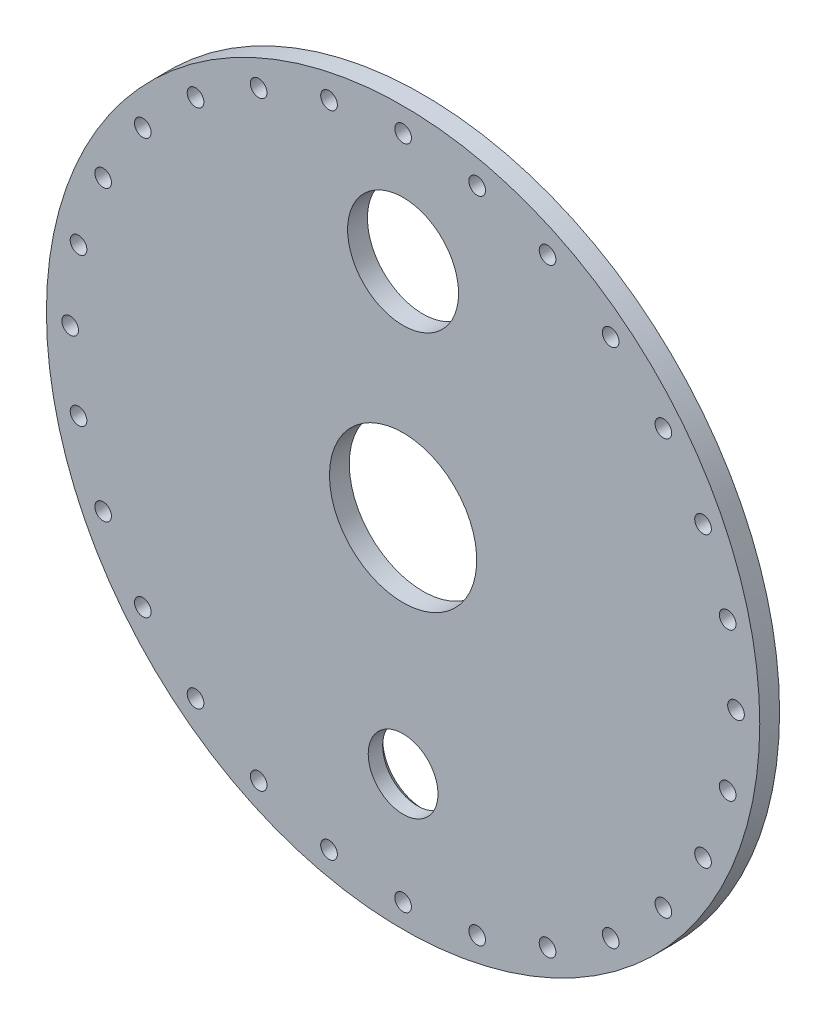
ISO-10303-21;
HEADER;
FILE_DESCRIPTION(('STEP AP214'),'2;1');
FILE_NAME('part.step','',(''),(''),'','','');
FILE_SCHEMA(('AUTOMOTIVE_DESIGN { 1 0 10303 214 1 1 1 1 }'));
ENDSEC;
DATA;
#1=APPLICATION_CONTEXT('core data for automotive mechanical design processes');
#2=APPLICATION_PROTOCOL_DEFINITION('international standard','automotive_design',2000,#1);
#3=PRODUCT_CONTEXT('',#1,'mechanical');
#4=PRODUCT('Part','Part','',(#3));
#5=PRODUCT_RELATED_PRODUCT_CATEGORY('part','',(#4));
#6=PRODUCT_DEFINITION_FORMATION('','',#4);
#7=PRODUCT_DEFINITION_CONTEXT('part definition',#1,'design');
#8=PRODUCT_DEFINITION('design','',#6,#7);
#9=PRODUCT_DEFINITION_SHAPE('','',#8);
#10=(LENGTH_UNIT() NAMED_UNIT(*) SI_UNIT(.MILLI.,.METRE.));
#11=(NAMED_UNIT(*) PLANE_ANGLE_UNIT() SI_UNIT($,.RADIAN.));
#12=(NAMED_UNIT(*) SI_UNIT($,.STERADIAN.) SOLID_ANGLE_UNIT());
#13=UNCERTAINTY_MEASURE_WITH_UNIT(LENGTH_MEASURE(1.E-05),#10,'distance_accuracy_value','');
#14=(GEOMETRIC_REPRESENTATION_CONTEXT(3) GLOBAL_UNCERTAINTY_ASSIGNED_CONTEXT((#13)) GLOBAL_UNIT_ASSIGNED_CONTEXT((#10,
#11,#12)) REPRESENTATION_CONTEXT('',''));
#15=CARTESIAN_POINT('',(0.,0.,0.));
#16=DIRECTION('',(0.,0.,1.));
#17=DIRECTION('',(1.,0.,0.));
#18=AXIS2_PLACEMENT_3D('',#15,#16,#17);
#19=CARTESIAN_POINT('',(0.,0.,0.));
#20=DIRECTION('',(0.,0.,1.));
#21=DIRECTION('',(1.,0.,0.));
#22=AXIS2_PLACEMENT_3D('',#19,#20,#21);
#23=PLANE('',#22);
#24=CARTESIAN_POINT('',(0.,0.,0.));
#25=DIRECTION('',(0.,0.,-1.));
#26=DIRECTION('',(-1.,0.,0.));
#27=AXIS2_PLACEMENT_3D('',#24,#25,#26);
#28=CIRCLE('',#27,46.45);
#29=CARTESIAN_POINT('',(-46.45,0.,0.));
#30=VERTEX_POINT('',#29);
#31=EDGE_CURVE('E224',#30,#30,#28,.T.);
#32=ORIENTED_EDGE('',*,*,#31,.F.);
#33=EDGE_LOOP('',(#32));
#34=FACE_BOUND('',#33,.T.);
#35=CARTESIAN_POINT('',(0.,0.,0.));
#36=DIRECTION('',(0.,0.,1.));
#37=DIRECTION('',(1.,0.,0.));
#38=AXIS2_PLACEMENT_3D('',#35,#36,#37);
#39=CIRCLE('',#38,225.);
#40=CARTESIAN_POINT('',(225.,0.,0.));
#41=VERTEX_POINT('',#40);
#42=EDGE_CURVE('E32',#41,#41,#39,.T.);
#43=ORIENTED_EDGE('',*,*,#42,.F.);
#44=EDGE_LOOP('',(#43));
#45=FACE_BOUND('',#44,.T.);
#46=CARTESIAN_POINT('',(0.,210.,0.));
#47=DIRECTION('',(0.,0.,1.));
#48=DIRECTION('',(1.,0.,0.));
#49=AXIS2_PLACEMENT_3D('',#46,#47,#48);
#50=CIRCLE('',#49,5.25);
#51=CARTESIAN_POINT('',(5.25,210.,0.));
#52=VERTEX_POINT('',#51);
#53=EDGE_CURVE('E39',#52,#52,#50,.T.);
#54=ORIENTED_EDGE('',*,*,#53,.T.);
#55=EDGE_LOOP('',(#54));
#56=FACE_BOUND('',#55,.T.);
#57=CARTESIAN_POINT('',(-46.7293961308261,204.734861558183,0.));
#58=DIRECTION('',(0.,0.,1.));
#59=DIRECTION('',(0.974927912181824,0.222520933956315,0.));
#60=AXIS2_PLACEMENT_3D('',#57,#58,#59);
#61=CIRCLE('',#60,5.25);
#62=CARTESIAN_POINT('',(-41.6110245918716,205.903096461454,0.));
#63=VERTEX_POINT('',#62);
#64=EDGE_CURVE('E44',#63,#63,#61,.T.);
#65=ORIENTED_EDGE('',*,*,#64,.T.);
#66=EDGE_LOOP('',(#65));
#67=FACE_BOUND('',#66,.T.);
#68=CARTESIAN_POINT('',(-91.1155852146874,189.203462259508,0.));
#69=DIRECTION('',(0.,0.,1.));
#70=DIRECTION('',(0.900968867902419,0.433883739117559,0.));
#71=AXIS2_PLACEMENT_3D('',#68,#69,#70);
#72=CIRCLE('',#71,5.25);
#73=CARTESIAN_POINT('',(-86.3854986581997,191.481351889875,0.));
#74=VERTEX_POINT('',#73);
#75=EDGE_CURVE('E50',#74,#74,#72,.T.);
#76=ORIENTED_EDGE('',*,*,#75,.T.);
#77=EDGE_LOOP('',(#76));
#78=FACE_BOUND('',#77,.T.);
#79=CARTESIAN_POINT('',(-130.932858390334,164.184611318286,0.));
#80=DIRECTION('',(0.,0.,1.));
#81=DIRECTION('',(0.781831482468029,0.623489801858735,0.));
#82=AXIS2_PLACEMENT_3D('',#79,#80,#81);
#83=CIRCLE('',#82,5.25);
#84=CARTESIAN_POINT('',(-126.828243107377,167.457932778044,0.));
#85=VERTEX_POINT('',#84);
#86=EDGE_CURVE('E56',#85,#85,#83,.T.);
#87=ORIENTED_EDGE('',*,*,#86,.T.);
#88=EDGE_LOOP('',(#87));
#89=FACE_BOUND('',#88,.T.);
#90=CARTESIAN_POINT('',(-164.184611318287,130.932858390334,0.));
#91=DIRECTION('',(0.,0.,1.));
#92=DIRECTION('',(0.623489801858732,0.781831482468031,0.));
#93=AXIS2_PLACEMENT_3D('',#90,#91,#92);
#94=CIRCLE('',#93,5.25);
#95=CARTESIAN_POINT('',(-160.911289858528,135.037473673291,0.));
#96=VERTEX_POINT('',#95);
#97=EDGE_CURVE('E62',#96,#96,#94,.T.);
#98=ORIENTED_EDGE('',*,*,#97,.T.);
#99=EDGE_LOOP('',(#98));
#100=FACE_BOUND('',#99,.T.);
#101=CARTESIAN_POINT('',(-189.203462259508,91.1155852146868,0.));
#102=DIRECTION('',(0.,0.,1.));
#103=DIRECTION('',(0.433883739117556,0.90096886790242,0.));
#104=AXIS2_PLACEMENT_3D('',#101,#102,#103);
#105=CIRCLE('',#104,5.25);
#106=CARTESIAN_POINT('',(-186.925572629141,95.8456717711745,0.));
#107=VERTEX_POINT('',#106);
#108=EDGE_CURVE('E68',#107,#107,#105,.T.);
#109=ORIENTED_EDGE('',*,*,#108,.T.);
#110=EDGE_LOOP('',(#109));
#111=FACE_BOUND('',#110,.T.);
#112=CARTESIAN_POINT('',(-204.734861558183,46.7293961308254,0.));
#113=DIRECTION('',(0.,0.,1.));
#114=DIRECTION('',(0.222520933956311,0.974927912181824,0.));
#115=AXIS2_PLACEMENT_3D('',#112,#113,#114);
#116=CIRCLE('',#115,5.25);
#117=CARTESIAN_POINT('',(-203.566626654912,51.84776766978,0.));
#118=VERTEX_POINT('',#117);
#119=EDGE_CURVE('E74',#118,#118,#116,.T.);
#120=ORIENTED_EDGE('',*,*,#119,.T.);
#121=EDGE_LOOP('',(#120));
#122=FACE_BOUND('',#121,.T.);
#123=CARTESIAN_POINT('',(-210.,-7.33211081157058E-13,0.));
#124=DIRECTION('',(0.,0.,1.));
#125=DIRECTION('',(0.,1.,0.));
#126=AXIS2_PLACEMENT_3D('',#123,#124,#125);
#127=CIRCLE('',#126,5.25);
#128=CARTESIAN_POINT('',(-210.,5.24999999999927,0.));
#129=VERTEX_POINT('',#128);
#130=EDGE_CURVE('E80',#129,#129,#127,.T.);
#131=ORIENTED_EDGE('',*,*,#130,.T.);
#132=EDGE_LOOP('',(#131));
#133=FACE_BOUND('',#132,.T.);
#134=CARTESIAN_POINT('',(-204.734861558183,-46.7293961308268,0.));
#135=DIRECTION('',(0.,0.,1.));
#136=DIRECTION('',(-0.222520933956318,0.974927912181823,0.));
#137=AXIS2_PLACEMENT_3D('',#134,#135,#136);
#138=CIRCLE('',#137,5.25);
#139=CARTESIAN_POINT('',(-205.903096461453,-41.6110245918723,0.));
#140=VERTEX_POINT('',#139);
#141=EDGE_CURVE('E86',#140,#140,#138,.T.);
#142=ORIENTED_EDGE('',*,*,#141,.T.);
#143=EDGE_LOOP('',(#142));
#144=FACE_BOUND('',#143,.T.);
#145=CARTESIAN_POINT('',(-189.203462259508,-91.115585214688,0.));
#146=DIRECTION('',(0.,0.,1.));
#147=DIRECTION('',(-0.433883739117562,0.900968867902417,0.));
#148=AXIS2_PLACEMENT_3D('',#145,#146,#147);
#149=CIRCLE('',#148,5.25);
#150=CARTESIAN_POINT('',(-191.481351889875,-86.3854986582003,0.));
#151=VERTEX_POINT('',#150);
#152=EDGE_CURVE('E92',#151,#151,#149,.T.);
#153=ORIENTED_EDGE('',*,*,#152,.T.);
#154=EDGE_LOOP('',(#153));
#155=FACE_BOUND('',#154,.T.);
#156=CARTESIAN_POINT('',(-164.184611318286,-130.932858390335,0.));
#157=DIRECTION('',(0.,0.,1.));
#158=DIRECTION('',(-0.623489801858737,0.781831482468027,0.));
#159=AXIS2_PLACEMENT_3D('',#156,#157,#158);
#160=CIRCLE('',#159,5.25);
#161=CARTESIAN_POINT('',(-167.457932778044,-126.828243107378,0.));
#162=VERTEX_POINT('',#161);
#163=EDGE_CURVE('E98',#162,#162,#160,.T.);
#164=ORIENTED_EDGE('',*,*,#163,.T.);
#165=EDGE_LOOP('',(#164));
#166=FACE_BOUND('',#165,.T.);
#167=CARTESIAN_POINT('',(-130.932858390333,-164.184611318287,0.));
#168=DIRECTION('',(0.,0.,1.));
#169=DIRECTION('',(-0.781831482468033,0.623489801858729,0.));
#170=AXIS2_PLACEMENT_3D('',#167,#168,#169);
#171=CIRCLE('',#170,5.25);
#172=CARTESIAN_POINT('',(-135.03747367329,-160.911289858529,0.));
#173=VERTEX_POINT('',#172);
#174=EDGE_CURVE('E104',#173,#173,#171,.T.);
#175=ORIENTED_EDGE('',*,*,#174,.T.);
#176=EDGE_LOOP('',(#175));
#177=FACE_BOUND('',#176,.T.);
#178=CARTESIAN_POINT('',(-91.115585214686,-189.203462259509,0.));
#179=DIRECTION('',(0.,0.,1.));
#180=DIRECTION('',(-0.900968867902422,0.433883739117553,0.));
#181=AXIS2_PLACEMENT_3D('',#178,#179,#180);
#182=CIRCLE('',#181,5.25);
#183=CARTESIAN_POINT('',(-95.8456717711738,-186.925572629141,0.));
#184=VERTEX_POINT('',#183);
#185=EDGE_CURVE('E110',#184,#184,#182,.T.);
#186=ORIENTED_EDGE('',*,*,#185,.T.);
#187=EDGE_LOOP('',(#186));
#188=FACE_BOUND('',#187,.T.);
#189=CARTESIAN_POINT('',(-46.7293961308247,-204.734861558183,0.));
#190=DIRECTION('',(0.,0.,1.));
#191=DIRECTION('',(-0.974927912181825,0.222520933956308,0.));
#192=AXIS2_PLACEMENT_3D('',#189,#190,#191);
#193=CIRCLE('',#192,5.25);
#194=CARTESIAN_POINT('',(-51.8477676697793,-203.566626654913,0.));
#195=VERTEX_POINT('',#194);
#196=EDGE_CURVE('E116',#195,#195,#193,.T.);
#197=ORIENTED_EDGE('',*,*,#196,.T.);
#198=EDGE_LOOP('',(#197));
#199=FACE_BOUND('',#198,.T.);
#200=CARTESIAN_POINT('',(0.,-210.,0.));
#201=DIRECTION('',(0.,0.,1.));
#202=DIRECTION('',(-1.,0.,0.));
#203=AXIS2_PLACEMENT_3D('',#200,#201,#202);
#204=CIRCLE('',#203,5.25);
#205=CARTESIAN_POINT('',(-5.25,-210.,0.));
#206=VERTEX_POINT('',#205);
#207=EDGE_CURVE('E122',#206,#206,#204,.T.);
#208=ORIENTED_EDGE('',*,*,#207,.T.);
#209=EDGE_LOOP('',(#208));
#210=FACE_BOUND('',#209,.T.);
#211=CARTESIAN_POINT('',(46.7293961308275,-204.734861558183,0.));
#212=DIRECTION('',(0.,0.,1.));
#213=DIRECTION('',(-0.974927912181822,-0.222520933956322,0.));
#214=AXIS2_PLACEMENT_3D('',#211,#212,#213);
#215=CIRCLE('',#214,5.25);
#216=CARTESIAN_POINT('',(41.611024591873,-205.903096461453,0.));
#217=VERTEX_POINT('',#216);
#218=EDGE_CURVE('E128',#217,#217,#215,.T.);
#219=ORIENTED_EDGE('',*,*,#218,.T.);
#220=EDGE_LOOP('',(#219));
#221=FACE_BOUND('',#220,.T.);
#222=CARTESIAN_POINT('',(91.1155852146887,-189.203462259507,0.));
#223=DIRECTION('',(0.,0.,1.));
#224=DIRECTION('',(-0.900968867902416,-0.433883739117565,0.));
#225=AXIS2_PLACEMENT_3D('',#222,#223,#224);
#226=CIRCLE('',#225,5.25);
#227=CARTESIAN_POINT('',(86.385498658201,-191.481351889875,0.));
#228=VERTEX_POINT('',#227);
#229=EDGE_CURVE('E134',#228,#228,#226,.T.);
#230=ORIENTED_EDGE('',*,*,#229,.T.);
#231=EDGE_LOOP('',(#230));
#232=FACE_BOUND('',#231,.T.);
#233=CARTESIAN_POINT('',(130.932858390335,-164.184611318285,0.));
#234=DIRECTION('',(0.,0.,1.));
#235=DIRECTION('',(-0.781831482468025,-0.62348980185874,0.));
#236=AXIS2_PLACEMENT_3D('',#233,#234,#235);
#237=CIRCLE('',#236,5.25);
#238=CARTESIAN_POINT('',(126.828243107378,-167.457932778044,0.));
#239=VERTEX_POINT('',#238);
#240=EDGE_CURVE('E140',#239,#239,#237,.T.);
#241=ORIENTED_EDGE('',*,*,#240,.T.);
#242=EDGE_LOOP('',(#241));
#243=FACE_BOUND('',#242,.T.);
#244=CARTESIAN_POINT('',(164.184611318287,-130.932858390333,0.));
#245=DIRECTION('',(0.,0.,1.));
#246=DIRECTION('',(-0.623489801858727,-0.781831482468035,0.));
#247=AXIS2_PLACEMENT_3D('',#244,#245,#246);
#248=CIRCLE('',#247,5.25);
#249=CARTESIAN_POINT('',(160.911289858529,-135.03747367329,0.));
#250=VERTEX_POINT('',#249);
#251=EDGE_CURVE('E146',#250,#250,#248,.T.);
#252=ORIENTED_EDGE('',*,*,#251,.T.);
#253=EDGE_LOOP('',(#252));
#254=FACE_BOUND('',#253,.T.);
#255=CARTESIAN_POINT('',(189.203462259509,-91.1155852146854,0.));
#256=DIRECTION('',(0.,0.,1.));
#257=DIRECTION('',(-0.433883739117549,-0.900968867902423,0.));
#258=AXIS2_PLACEMENT_3D('',#255,#256,#257);
#259=CIRCLE('',#258,5.25);
#260=CARTESIAN_POINT('',(186.925572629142,-95.8456717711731,0.));
#261=VERTEX_POINT('',#260);
#262=EDGE_CURVE('E152',#261,#261,#259,.T.);
#263=ORIENTED_EDGE('',*,*,#262,.T.);
#264=EDGE_LOOP('',(#263));
#265=FACE_BOUND('',#264,.T.);
#266=CARTESIAN_POINT('',(204.734861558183,-46.7293961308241,0.));
#267=DIRECTION('',(0.,0.,1.));
#268=DIRECTION('',(-0.222520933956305,-0.974927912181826,0.));
#269=AXIS2_PLACEMENT_3D('',#266,#267,#268);
#270=CIRCLE('',#269,5.25);
#271=CARTESIAN_POINT('',(203.566626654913,-51.8477676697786,0.));
#272=VERTEX_POINT('',#271);
#273=EDGE_CURVE('E158',#272,#272,#270,.T.);
#274=ORIENTED_EDGE('',*,*,#273,.T.);
#275=EDGE_LOOP('',(#274));
#276=FACE_BOUND('',#275,.T.);
#277=CARTESIAN_POINT('',(210.,2.19963324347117E-12,0.));
#278=DIRECTION('',(0.,0.,1.));
#279=DIRECTION('',(0.,-1.,0.));
#280=AXIS2_PLACEMENT_3D('',#277,#278,#279);
#281=CIRCLE('',#280,5.25);
#282=CARTESIAN_POINT('',(210.,-5.2499999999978,0.));
#283=VERTEX_POINT('',#282);
#284=EDGE_CURVE('E164',#283,#283,#281,.T.);
#285=ORIENTED_EDGE('',*,*,#284,.T.);
#286=EDGE_LOOP('',(#285));
#287=FACE_BOUND('',#286,.T.);
#288=CARTESIAN_POINT('',(204.734861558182,46.7293961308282,0.));
#289=DIRECTION('',(0.,0.,1.));
#290=DIRECTION('',(0.222520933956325,-0.974927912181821,0.));
#291=AXIS2_PLACEMENT_3D('',#288,#289,#290);
#292=CIRCLE('',#291,5.25);
#293=CARTESIAN_POINT('',(205.903096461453,41.6110245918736,0.));
#294=VERTEX_POINT('',#293);
#295=EDGE_CURVE('E170',#294,#294,#292,.T.);
#296=ORIENTED_EDGE('',*,*,#295,.T.);
#297=EDGE_LOOP('',(#296));
#298=FACE_BOUND('',#297,.T.);
#299=CARTESIAN_POINT('',(189.203462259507,91.1155852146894,0.));
#300=DIRECTION('',(0.,0.,1.));
#301=DIRECTION('',(0.433883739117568,-0.900968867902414,0.));
#302=AXIS2_PLACEMENT_3D('',#299,#300,#301);
#303=CIRCLE('',#302,5.25);
#304=CARTESIAN_POINT('',(191.481351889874,86.3854986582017,0.));
#305=VERTEX_POINT('',#304);
#306=EDGE_CURVE('E176',#305,#305,#303,.T.);
#307=ORIENTED_EDGE('',*,*,#306,.T.);
#308=EDGE_LOOP('',(#307));
#309=FACE_BOUND('',#308,.T.);
#310=CARTESIAN_POINT('',(164.184611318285,130.932858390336,0.));
#311=DIRECTION('',(0.,0.,1.));
#312=DIRECTION('',(0.623489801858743,-0.781831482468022,0.));
#313=AXIS2_PLACEMENT_3D('',#310,#311,#312);
#314=CIRCLE('',#313,5.25);
#315=CARTESIAN_POINT('',(167.457932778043,126.828243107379,0.));
#316=VERTEX_POINT('',#315);
#317=EDGE_CURVE('E182',#316,#316,#314,.T.);
#318=ORIENTED_EDGE('',*,*,#317,.T.);
#319=EDGE_LOOP('',(#318));
#320=FACE_BOUND('',#319,.T.);
#321=CARTESIAN_POINT('',(130.932858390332,164.184611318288,0.));
#322=DIRECTION('',(0.,0.,1.));
#323=DIRECTION('',(0.781831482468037,-0.623489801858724,0.));
#324=AXIS2_PLACEMENT_3D('',#321,#322,#323);
#325=CIRCLE('',#324,5.25);
#326=CARTESIAN_POINT('',(135.037473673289,160.91128985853,0.));
#327=VERTEX_POINT('',#326);
#328=EDGE_CURVE('E188',#327,#327,#325,.T.);
#329=ORIENTED_EDGE('',*,*,#328,.T.);
#330=EDGE_LOOP('',(#329));
#331=FACE_BOUND('',#330,.T.);
#332=CARTESIAN_POINT('',(91.1155852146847,189.203462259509,0.));
#333=DIRECTION('',(0.,0.,1.));
#334=DIRECTION('',(0.900968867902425,-0.433883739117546,0.));
#335=AXIS2_PLACEMENT_3D('',#332,#333,#334);
#336=CIRCLE('',#335,5.25);
#337=CARTESIAN_POINT('',(95.8456717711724,186.925572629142,0.));
#338=VERTEX_POINT('',#337);
#339=EDGE_CURVE('E194',#338,#338,#336,.T.);
#340=ORIENTED_EDGE('',*,*,#339,.T.);
#341=EDGE_LOOP('',(#340));
#342=FACE_BOUND('',#341,.T.);
#343=CARTESIAN_POINT('',(46.7293961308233,204.734861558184,0.));
#344=DIRECTION('',(0.,0.,1.));
#345=DIRECTION('',(0.974927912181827,-0.222520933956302,0.));
#346=AXIS2_PLACEMENT_3D('',#343,#344,#345);
#347=CIRCLE('',#346,5.25);
#348=CARTESIAN_POINT('',(51.8477676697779,203.566626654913,0.));
#349=VERTEX_POINT('',#348);
#350=EDGE_CURVE('E200',#349,#349,#347,.T.);
#351=ORIENTED_EDGE('',*,*,#350,.T.);
#352=EDGE_LOOP('',(#351));
#353=FACE_BOUND('',#352,.T.);
#354=CARTESIAN_POINT('',(0.,140.,0.));
#355=DIRECTION('',(0.,0.,1.));
#356=DIRECTION('',(1.,0.,0.));
#357=AXIS2_PLACEMENT_3D('',#354,#355,#356);
#358=CIRCLE('',#357,35.);
#359=CARTESIAN_POINT('',(35.,140.,0.));
#360=VERTEX_POINT('',#359);
#361=EDGE_CURVE('E206',#360,#360,#358,.T.);
#362=ORIENTED_EDGE('',*,*,#361,.T.);
#363=EDGE_LOOP('',(#362));
#364=FACE_BOUND('',#363,.T.);
#365=CARTESIAN_POINT('',(0.,-140.,0.));
#366=DIRECTION('',(0.,0.,-1.));
#367=DIRECTION('',(-1.,0.,0.));
#368=AXIS2_PLACEMENT_3D('',#365,#366,#367);
#369=CIRCLE('',#368,25.4);
#370=CARTESIAN_POINT('',(-25.4,-140.,0.));
#371=VERTEX_POINT('',#370);
#372=EDGE_CURVE('E220',#371,#371,#369,.T.);
#373=ORIENTED_EDGE('',*,*,#372,.F.);
#374=EDGE_LOOP('',(#373));
#375=FACE_BOUND('',#374,.T.);
#376=ADVANCED_FACE('F28',(#34,#45,#56,#67,#78,#89,#100,#111,#122,#133,#144,#155,#166,#177,#188,
#199,#210,#221,#232,#243,#254,#265,#276,#287,#298,#309,#320,#331,#342,#353,#364,#375),#23,.F.);
#377=CARTESIAN_POINT('',(0.,0.,12.5));
#378=DIRECTION('',(0.,0.,1.));
#379=DIRECTION('',(1.,0.,0.));
#380=AXIS2_PLACEMENT_3D('',#377,#378,#379);
#381=PLANE('',#380);
#382=CARTESIAN_POINT('',(0.,0.,12.5));
#383=DIRECTION('',(0.,0.,-1.));
#384=DIRECTION('',(-1.,0.,0.));
#385=AXIS2_PLACEMENT_3D('',#382,#383,#384);
#386=CIRCLE('',#385,46.45);
#387=CARTESIAN_POINT('',(-46.45,0.,12.5));
#388=VERTEX_POINT('',#387);
#389=EDGE_CURVE('E223',#388,#388,#386,.T.);
#390=ORIENTED_EDGE('',*,*,#389,.T.);
#391=EDGE_LOOP('',(#390));
#392=FACE_BOUND('',#391,.T.);
#393=CARTESIAN_POINT('',(0.,0.,12.5));
#394=DIRECTION('',(0.,0.,1.));
#395=DIRECTION('',(1.,0.,0.));
#396=AXIS2_PLACEMENT_3D('',#393,#394,#395);
#397=CIRCLE('',#396,225.);
#398=CARTESIAN_POINT('',(225.,0.,12.5));
#399=VERTEX_POINT('',#398);
#400=EDGE_CURVE('E10',#399,#399,#397,.T.);
#401=ORIENTED_EDGE('',*,*,#400,.T.);
#402=EDGE_LOOP('',(#401));
#403=FACE_BOUND('',#402,.T.);
#404=CARTESIAN_POINT('',(0.,210.,12.5));
#405=DIRECTION('',(0.,0.,1.));
#406=DIRECTION('',(1.,0.,0.));
#407=AXIS2_PLACEMENT_3D('',#404,#405,#406);
#408=CIRCLE('',#407,5.25);
#409=CARTESIAN_POINT('',(5.25,210.,12.5));
#410=VERTEX_POINT('',#409);
#411=EDGE_CURVE('E41',#410,#410,#408,.T.);
#412=ORIENTED_EDGE('',*,*,#411,.F.);
#413=EDGE_LOOP('',(#412));
#414=FACE_BOUND('',#413,.T.);
#415=CARTESIAN_POINT('',(-46.7293961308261,204.734861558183,12.5));
#416=DIRECTION('',(0.,0.,1.));
#417=DIRECTION('',(0.974927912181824,0.222520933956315,0.));
#418=AXIS2_PLACEMENT_3D('',#415,#416,#417);
#419=CIRCLE('',#418,5.25);
#420=CARTESIAN_POINT('',(-41.6110245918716,205.903096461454,12.5));
#421=VERTEX_POINT('',#420);
#422=EDGE_CURVE('E47',#421,#421,#419,.T.);
#423=ORIENTED_EDGE('',*,*,#422,.F.);
#424=EDGE_LOOP('',(#423));
#425=FACE_BOUND('',#424,.T.);
#426=CARTESIAN_POINT('',(-91.1155852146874,189.203462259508,12.5));
#427=DIRECTION('',(0.,0.,1.));
#428=DIRECTION('',(0.900968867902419,0.433883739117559,0.));
#429=AXIS2_PLACEMENT_3D('',#426,#427,#428);
#430=CIRCLE('',#429,5.25);
#431=CARTESIAN_POINT('',(-86.3854986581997,191.481351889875,12.5));
#432=VERTEX_POINT('',#431);
#433=EDGE_CURVE('E53',#432,#432,#430,.T.);
#434=ORIENTED_EDGE('',*,*,#433,.F.);
#435=EDGE_LOOP('',(#434));
#436=FACE_BOUND('',#435,.T.);
#437=CARTESIAN_POINT('',(-130.932858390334,164.184611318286,12.5));
#438=DIRECTION('',(0.,0.,1.));
#439=DIRECTION('',(0.781831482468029,0.623489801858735,0.));
#440=AXIS2_PLACEMENT_3D('',#437,#438,#439);
#441=CIRCLE('',#440,5.25);
#442=CARTESIAN_POINT('',(-126.828243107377,167.457932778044,12.5));
#443=VERTEX_POINT('',#442);
#444=EDGE_CURVE('E59',#443,#443,#441,.T.);
#445=ORIENTED_EDGE('',*,*,#444,.F.);
#446=EDGE_LOOP('',(#445));
#447=FACE_BOUND('',#446,.T.);
#448=CARTESIAN_POINT('',(-164.184611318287,130.932858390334,12.5));
#449=DIRECTION('',(0.,0.,1.));
#450=DIRECTION('',(0.623489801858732,0.781831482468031,0.));
#451=AXIS2_PLACEMENT_3D('',#448,#449,#450);
#452=CIRCLE('',#451,5.25);
#453=CARTESIAN_POINT('',(-160.911289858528,135.037473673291,12.5));
#454=VERTEX_POINT('',#453);
#455=EDGE_CURVE('E65',#454,#454,#452,.T.);
#456=ORIENTED_EDGE('',*,*,#455,.F.);
#457=EDGE_LOOP('',(#456));
#458=FACE_BOUND('',#457,.T.);
#459=CARTESIAN_POINT('',(-189.203462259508,91.1155852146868,12.5));
#460=DIRECTION('',(0.,0.,1.));
#461=DIRECTION('',(0.433883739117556,0.90096886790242,0.));
#462=AXIS2_PLACEMENT_3D('',#459,#460,#461);
#463=CIRCLE('',#462,5.25);
#464=CARTESIAN_POINT('',(-186.925572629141,95.8456717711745,12.5));
#465=VERTEX_POINT('',#464);
#466=EDGE_CURVE('E71',#465,#465,#463,.T.);
#467=ORIENTED_EDGE('',*,*,#466,.F.);
#468=EDGE_LOOP('',(#467));
#469=FACE_BOUND('',#468,.T.);
#470=CARTESIAN_POINT('',(-204.734861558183,46.7293961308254,12.5));
#471=DIRECTION('',(0.,0.,1.));
#472=DIRECTION('',(0.222520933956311,0.974927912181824,0.));
#473=AXIS2_PLACEMENT_3D('',#470,#471,#472);
#474=CIRCLE('',#473,5.25);
#475=CARTESIAN_POINT('',(-203.566626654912,51.84776766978,12.5));
#476=VERTEX_POINT('',#475);
#477=EDGE_CURVE('E77',#476,#476,#474,.T.);
#478=ORIENTED_EDGE('',*,*,#477,.F.);
#479=EDGE_LOOP('',(#478));
#480=FACE_BOUND('',#479,.T.);
#481=CARTESIAN_POINT('',(-210.,-7.33211081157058E-13,12.5));
#482=DIRECTION('',(0.,0.,1.));
#483=DIRECTION('',(0.,1.,0.));
#484=AXIS2_PLACEMENT_3D('',#481,#482,#483);
#485=CIRCLE('',#484,5.25);
#486=CARTESIAN_POINT('',(-210.,5.24999999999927,12.5));
#487=VERTEX_POINT('',#486);
#488=EDGE_CURVE('E83',#487,#487,#485,.T.);
#489=ORIENTED_EDGE('',*,*,#488,.F.);
#490=EDGE_LOOP('',(#489));
#491=FACE_BOUND('',#490,.T.);
#492=CARTESIAN_POINT('',(-204.734861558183,-46.7293961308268,12.5));
#493=DIRECTION('',(0.,0.,1.));
#494=DIRECTION('',(-0.222520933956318,0.974927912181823,0.));
#495=AXIS2_PLACEMENT_3D('',#492,#493,#494);
#496=CIRCLE('',#495,5.25);
#497=CARTESIAN_POINT('',(-205.903096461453,-41.6110245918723,12.5));
#498=VERTEX_POINT('',#497);
#499=EDGE_CURVE('E89',#498,#498,#496,.T.);
#500=ORIENTED_EDGE('',*,*,#499,.F.);
#501=EDGE_LOOP('',(#500));
#502=FACE_BOUND('',#501,.T.);
#503=CARTESIAN_POINT('',(-189.203462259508,-91.115585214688,12.5));
#504=DIRECTION('',(0.,0.,1.));
#505=DIRECTION('',(-0.433883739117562,0.900968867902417,0.));
#506=AXIS2_PLACEMENT_3D('',#503,#504,#505);
#507=CIRCLE('',#506,5.25);
#508=CARTESIAN_POINT('',(-191.481351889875,-86.3854986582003,12.5));
#509=VERTEX_POINT('',#508);
#510=EDGE_CURVE('E95',#509,#509,#507,.T.);
#511=ORIENTED_EDGE('',*,*,#510,.F.);
#512=EDGE_LOOP('',(#511));
#513=FACE_BOUND('',#512,.T.);
#514=CARTESIAN_POINT('',(-164.184611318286,-130.932858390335,12.5));
#515=DIRECTION('',(0.,0.,1.));
#516=DIRECTION('',(-0.623489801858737,0.781831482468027,0.));
#517=AXIS2_PLACEMENT_3D('',#514,#515,#516);
#518=CIRCLE('',#517,5.25);
#519=CARTESIAN_POINT('',(-167.457932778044,-126.828243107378,12.5));
#520=VERTEX_POINT('',#519);
#521=EDGE_CURVE('E101',#520,#520,#518,.T.);
#522=ORIENTED_EDGE('',*,*,#521,.F.);
#523=EDGE_LOOP('',(#522));
#524=FACE_BOUND('',#523,.T.);
#525=CARTESIAN_POINT('',(-130.932858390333,-164.184611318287,12.5));
#526=DIRECTION('',(0.,0.,1.));
#527=DIRECTION('',(-0.781831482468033,0.623489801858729,0.));
#528=AXIS2_PLACEMENT_3D('',#525,#526,#527);
#529=CIRCLE('',#528,5.25);
#530=CARTESIAN_POINT('',(-135.03747367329,-160.911289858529,12.5));
#531=VERTEX_POINT('',#530);
#532=EDGE_CURVE('E107',#531,#531,#529,.T.);
#533=ORIENTED_EDGE('',*,*,#532,.F.);
#534=EDGE_LOOP('',(#533));
#535=FACE_BOUND('',#534,.T.);
#536=CARTESIAN_POINT('',(-91.115585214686,-189.203462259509,12.5));
#537=DIRECTION('',(0.,0.,1.));
#538=DIRECTION('',(-0.900968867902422,0.433883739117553,0.));
#539=AXIS2_PLACEMENT_3D('',#536,#537,#538);
#540=CIRCLE('',#539,5.25);
#541=CARTESIAN_POINT('',(-95.8456717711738,-186.925572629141,12.5));
#542=VERTEX_POINT('',#541);
#543=EDGE_CURVE('E113',#542,#542,#540,.T.);
#544=ORIENTED_EDGE('',*,*,#543,.F.);
#545=EDGE_LOOP('',(#544));
#546=FACE_BOUND('',#545,.T.);
#547=CARTESIAN_POINT('',(-46.7293961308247,-204.734861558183,12.5));
#548=DIRECTION('',(0.,0.,1.));
#549=DIRECTION('',(-0.974927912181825,0.222520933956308,0.));
#550=AXIS2_PLACEMENT_3D('',#547,#548,#549);
#551=CIRCLE('',#550,5.25);
#552=CARTESIAN_POINT('',(-51.8477676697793,-203.566626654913,12.5));
#553=VERTEX_POINT('',#552);
#554=EDGE_CURVE('E119',#553,#553,#551,.T.);
#555=ORIENTED_EDGE('',*,*,#554,.F.);
#556=EDGE_LOOP('',(#555));
#557=FACE_BOUND('',#556,.T.);
#558=CARTESIAN_POINT('',(0.,-210.,12.5));
#559=DIRECTION('',(0.,0.,1.));
#560=DIRECTION('',(-1.,0.,0.));
#561=AXIS2_PLACEMENT_3D('',#558,#559,#560);
#562=CIRCLE('',#561,5.25);
#563=CARTESIAN_POINT('',(-5.25,-210.,12.5));
#564=VERTEX_POINT('',#563);
#565=EDGE_CURVE('E125',#564,#564,#562,.T.);
#566=ORIENTED_EDGE('',*,*,#565,.F.);
#567=EDGE_LOOP('',(#566));
#568=FACE_BOUND('',#567,.T.);
#569=CARTESIAN_POINT('',(46.7293961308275,-204.734861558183,12.5));
#570=DIRECTION('',(0.,0.,1.));
#571=DIRECTION('',(-0.974927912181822,-0.222520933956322,0.));
#572=AXIS2_PLACEMENT_3D('',#569,#570,#571);
#573=CIRCLE('',#572,5.25);
#574=CARTESIAN_POINT('',(41.611024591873,-205.903096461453,12.5));
#575=VERTEX_POINT('',#574);
#576=EDGE_CURVE('E131',#575,#575,#573,.T.);
#577=ORIENTED_EDGE('',*,*,#576,.F.);
#578=EDGE_LOOP('',(#577));
#579=FACE_BOUND('',#578,.T.);
#580=CARTESIAN_POINT('',(91.1155852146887,-189.203462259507,12.5));
#581=DIRECTION('',(0.,0.,1.));
#582=DIRECTION('',(-0.900968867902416,-0.433883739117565,0.));
#583=AXIS2_PLACEMENT_3D('',#580,#581,#582);
#584=CIRCLE('',#583,5.25);
#585=CARTESIAN_POINT('',(86.385498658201,-191.481351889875,12.5));
#586=VERTEX_POINT('',#585);
#587=EDGE_CURVE('E137',#586,#586,#584,.T.);
#588=ORIENTED_EDGE('',*,*,#587,.F.);
#589=EDGE_LOOP('',(#588));
#590=FACE_BOUND('',#589,.T.);
#591=CARTESIAN_POINT('',(130.932858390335,-164.184611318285,12.5));
#592=DIRECTION('',(0.,0.,1.));
#593=DIRECTION('',(-0.781831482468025,-0.62348980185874,0.));
#594=AXIS2_PLACEMENT_3D('',#591,#592,#593);
#595=CIRCLE('',#594,5.25);
#596=CARTESIAN_POINT('',(126.828243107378,-167.457932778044,12.5));
#597=VERTEX_POINT('',#596);
#598=EDGE_CURVE('E143',#597,#597,#595,.T.);
#599=ORIENTED_EDGE('',*,*,#598,.F.);
#600=EDGE_LOOP('',(#599));
#601=FACE_BOUND('',#600,.T.);
#602=CARTESIAN_POINT('',(164.184611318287,-130.932858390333,12.5));
#603=DIRECTION('',(0.,0.,1.));
#604=DIRECTION('',(-0.623489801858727,-0.781831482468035,0.));
#605=AXIS2_PLACEMENT_3D('',#602,#603,#604);
#606=CIRCLE('',#605,5.25);
#607=CARTESIAN_POINT('',(160.911289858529,-135.03747367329,12.5));
#608=VERTEX_POINT('',#607);
#609=EDGE_CURVE('E149',#608,#608,#606,.T.);
#610=ORIENTED_EDGE('',*,*,#609,.F.);
#611=EDGE_LOOP('',(#610));
#612=FACE_BOUND('',#611,.T.);
#613=CARTESIAN_POINT('',(189.203462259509,-91.1155852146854,12.5));
#614=DIRECTION('',(0.,0.,1.));
#615=DIRECTION('',(-0.433883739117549,-0.900968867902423,0.));
#616=AXIS2_PLACEMENT_3D('',#613,#614,#615);
#617=CIRCLE('',#616,5.25);
#618=CARTESIAN_POINT('',(186.925572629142,-95.8456717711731,12.5));
#619=VERTEX_POINT('',#618);
#620=EDGE_CURVE('E155',#619,#619,#617,.T.);
#621=ORIENTED_EDGE('',*,*,#620,.F.);
#622=EDGE_LOOP('',(#621));
#623=FACE_BOUND('',#622,.T.);
#624=CARTESIAN_POINT('',(204.734861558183,-46.7293961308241,12.5));
#625=DIRECTION('',(0.,0.,1.));
#626=DIRECTION('',(-0.222520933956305,-0.974927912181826,0.));
#627=AXIS2_PLACEMENT_3D('',#624,#625,#626);
#628=CIRCLE('',#627,5.25);
#629=CARTESIAN_POINT('',(203.566626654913,-51.8477676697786,12.5));
#630=VERTEX_POINT('',#629);
#631=EDGE_CURVE('E161',#630,#630,#628,.T.);
#632=ORIENTED_EDGE('',*,*,#631,.F.);
#633=EDGE_LOOP('',(#632));
#634=FACE_BOUND('',#633,.T.);
#635=CARTESIAN_POINT('',(210.,2.19963324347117E-12,12.5));
#636=DIRECTION('',(0.,0.,1.));
#637=DIRECTION('',(0.,-1.,0.));
#638=AXIS2_PLACEMENT_3D('',#635,#636,#637);
#639=CIRCLE('',#638,5.25);
#640=CARTESIAN_POINT('',(210.,-5.2499999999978,12.5));
#641=VERTEX_POINT('',#640);
#642=EDGE_CURVE('E167',#641,#641,#639,.T.);
#643=ORIENTED_EDGE('',*,*,#642,.F.);
#644=EDGE_LOOP('',(#643));
#645=FACE_BOUND('',#644,.T.);
#646=CARTESIAN_POINT('',(204.734861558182,46.7293961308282,12.5));
#647=DIRECTION('',(0.,0.,1.));
#648=DIRECTION('',(0.222520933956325,-0.974927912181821,0.));
#649=AXIS2_PLACEMENT_3D('',#646,#647,#648);
#650=CIRCLE('',#649,5.25);
#651=CARTESIAN_POINT('',(205.903096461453,41.6110245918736,12.5));
#652=VERTEX_POINT('',#651);
#653=EDGE_CURVE('E173',#652,#652,#650,.T.);
#654=ORIENTED_EDGE('',*,*,#653,.F.);
#655=EDGE_LOOP('',(#654));
#656=FACE_BOUND('',#655,.T.);
#657=CARTESIAN_POINT('',(189.203462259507,91.1155852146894,12.5));
#658=DIRECTION('',(0.,0.,1.));
#659=DIRECTION('',(0.433883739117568,-0.900968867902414,0.));
#660=AXIS2_PLACEMENT_3D('',#657,#658,#659);
#661=CIRCLE('',#660,5.25);
#662=CARTESIAN_POINT('',(191.481351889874,86.3854986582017,12.5));
#663=VERTEX_POINT('',#662);
#664=EDGE_CURVE('E179',#663,#663,#661,.T.);
#665=ORIENTED_EDGE('',*,*,#664,.F.);
#666=EDGE_LOOP('',(#665));
#667=FACE_BOUND('',#666,.T.);
#668=CARTESIAN_POINT('',(164.184611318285,130.932858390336,12.5));
#669=DIRECTION('',(0.,0.,1.));
#670=DIRECTION('',(0.623489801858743,-0.781831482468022,0.));
#671=AXIS2_PLACEMENT_3D('',#668,#669,#670);
#672=CIRCLE('',#671,5.25);
#673=CARTESIAN_POINT('',(167.457932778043,126.828243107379,12.5));
#674=VERTEX_POINT('',#673);
#675=EDGE_CURVE('E185',#674,#674,#672,.T.);
#676=ORIENTED_EDGE('',*,*,#675,.F.);
#677=EDGE_LOOP('',(#676));
#678=FACE_BOUND('',#677,.T.);
#679=CARTESIAN_POINT('',(130.932858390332,164.184611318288,12.5));
#680=DIRECTION('',(0.,0.,1.));
#681=DIRECTION('',(0.781831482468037,-0.623489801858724,0.));
#682=AXIS2_PLACEMENT_3D('',#679,#680,#681);
#683=CIRCLE('',#682,5.25);
#684=CARTESIAN_POINT('',(135.037473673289,160.91128985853,12.5));
#685=VERTEX_POINT('',#684);
#686=EDGE_CURVE('E191',#685,#685,#683,.T.);
#687=ORIENTED_EDGE('',*,*,#686,.F.);
#688=EDGE_LOOP('',(#687));
#689=FACE_BOUND('',#688,.T.);
#690=CARTESIAN_POINT('',(91.1155852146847,189.203462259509,12.5));
#691=DIRECTION('',(0.,0.,1.));
#692=DIRECTION('',(0.900968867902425,-0.433883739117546,0.));
#693=AXIS2_PLACEMENT_3D('',#690,#691,#692);
#694=CIRCLE('',#693,5.25);
#695=CARTESIAN_POINT('',(95.8456717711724,186.925572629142,12.5));
#696=VERTEX_POINT('',#695);
#697=EDGE_CURVE('E197',#696,#696,#694,.T.);
#698=ORIENTED_EDGE('',*,*,#697,.F.);
#699=EDGE_LOOP('',(#698));
#700=FACE_BOUND('',#699,.T.);
#701=CARTESIAN_POINT('',(46.7293961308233,204.734861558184,12.5));
#702=DIRECTION('',(0.,0.,1.));
#703=DIRECTION('',(0.974927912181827,-0.222520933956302,0.));
#704=AXIS2_PLACEMENT_3D('',#701,#702,#703);
#705=CIRCLE('',#704,5.25);
#706=CARTESIAN_POINT('',(51.8477676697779,203.566626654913,12.5));
#707=VERTEX_POINT('',#706);
#708=EDGE_CURVE('E203',#707,#707,#705,.T.);
#709=ORIENTED_EDGE('',*,*,#708,.F.);
#710=EDGE_LOOP('',(#709));
#711=FACE_BOUND('',#710,.T.);
#712=CARTESIAN_POINT('',(0.,140.,12.5));
#713=DIRECTION('',(0.,0.,1.));
#714=DIRECTION('',(1.,0.,0.));
#715=AXIS2_PLACEMENT_3D('',#712,#713,#714);
#716=CIRCLE('',#715,35.);
#717=CARTESIAN_POINT('',(35.,140.,12.5));
#718=VERTEX_POINT('',#717);
#719=EDGE_CURVE('E209',#718,#718,#716,.T.);
#720=ORIENTED_EDGE('',*,*,#719,.F.);
#721=EDGE_LOOP('',(#720));
#722=FACE_BOUND('',#721,.T.);
#723=CARTESIAN_POINT('',(0.,-140.,12.5));
#724=DIRECTION('',(0.,0.,-1.));
#725=DIRECTION('',(-1.,0.,0.));
#726=AXIS2_PLACEMENT_3D('',#723,#724,#725);
#727=CIRCLE('',#726,22.);
#728=CARTESIAN_POINT('',(-22.,-140.,12.5));
#729=VERTEX_POINT('',#728);
#730=EDGE_CURVE('E212',#729,#729,#727,.T.);
#731=ORIENTED_EDGE('',*,*,#730,.T.);
#732=EDGE_LOOP('',(#731));
#733=FACE_BOUND('',#732,.T.);
#734=ADVANCED_FACE('F230',(#392,#403,#414,#425,#436,#447,#458,#469,#480,#491,#502,#513,#524,
#535,#546,#557,#568,#579,#590,#601,#612,#623,#634,#645,#656,#667,#678,#689,#700,#711,#722,#733),
#381,.T.);
#735=CARTESIAN_POINT('',(0.,0.,12.5));
#736=DIRECTION('',(0.,0.,-1.));
#737=DIRECTION('',(-1.,0.,0.));
#738=AXIS2_PLACEMENT_3D('',#735,#736,#737);
#739=CYLINDRICAL_SURFACE('',#738,225.);
#740=ORIENTED_EDGE('',*,*,#400,.F.);
#741=EDGE_LOOP('',(#740));
#742=FACE_BOUND('',#741,.T.);
#743=ORIENTED_EDGE('',*,*,#42,.T.);
#744=EDGE_LOOP('',(#743));
#745=FACE_BOUND('',#744,.T.);
#746=ADVANCED_FACE('F30',(#742,#745),#739,.T.);
#747=CARTESIAN_POINT('',(0.,210.,0.));
#748=DIRECTION('',(0.,0.,1.));
#749=DIRECTION('',(1.,0.,0.));
#750=AXIS2_PLACEMENT_3D('',#747,#748,#749);
#751=CYLINDRICAL_SURFACE('',#750,5.25);
#752=ORIENTED_EDGE('',*,*,#53,.F.);
#753=EDGE_LOOP('',(#752));
#754=FACE_BOUND('',#753,.T.);
#755=ORIENTED_EDGE('',*,*,#411,.T.);
#756=EDGE_LOOP('',(#755));
#757=FACE_BOUND('',#756,.T.);
#758=ADVANCED_FACE('F425',(#754,#757),#751,.F.);
#759=CARTESIAN_POINT('',(-46.7293961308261,204.734861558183,0.));
#760=DIRECTION('',(0.,0.,1.));
#761=DIRECTION('',(1.,0.,0.));
#762=AXIS2_PLACEMENT_3D('',#759,#760,#761);
#763=CYLINDRICAL_SURFACE('',#762,5.25);
#764=ORIENTED_EDGE('',*,*,#64,.F.);
#765=EDGE_LOOP('',(#764));
#766=FACE_BOUND('',#765,.T.);
#767=ORIENTED_EDGE('',*,*,#422,.T.);
#768=EDGE_LOOP('',(#767));
#769=FACE_BOUND('',#768,.T.);
#770=ADVANCED_FACE('F421',(#766,#769),#763,.F.);
#771=CARTESIAN_POINT('',(-91.1155852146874,189.203462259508,0.));
#772=DIRECTION('',(0.,0.,1.));
#773=DIRECTION('',(1.,0.,0.));
#774=AXIS2_PLACEMENT_3D('',#771,#772,#773);
#775=CYLINDRICAL_SURFACE('',#774,5.25);
#776=ORIENTED_EDGE('',*,*,#75,.F.);
#777=EDGE_LOOP('',(#776));
#778=FACE_BOUND('',#777,.T.);
#779=ORIENTED_EDGE('',*,*,#433,.T.);
#780=EDGE_LOOP('',(#779));
#781=FACE_BOUND('',#780,.T.);
#782=ADVANCED_FACE('F417',(#778,#781),#775,.F.);
#783=CARTESIAN_POINT('',(-130.932858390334,164.184611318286,0.));
#784=DIRECTION('',(0.,0.,1.));
#785=DIRECTION('',(1.,0.,0.));
#786=AXIS2_PLACEMENT_3D('',#783,#784,#785);
#787=CYLINDRICAL_SURFACE('',#786,5.25);
#788=ORIENTED_EDGE('',*,*,#86,.F.);
#789=EDGE_LOOP('',(#788));
#790=FACE_BOUND('',#789,.T.);
#791=ORIENTED_EDGE('',*,*,#444,.T.);
#792=EDGE_LOOP('',(#791));
#793=FACE_BOUND('',#792,.T.);
#794=ADVANCED_FACE('F413',(#790,#793),#787,.F.);
#795=CARTESIAN_POINT('',(-164.184611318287,130.932858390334,0.));
#796=DIRECTION('',(0.,0.,1.));
#797=DIRECTION('',(1.,0.,0.));
#798=AXIS2_PLACEMENT_3D('',#795,#796,#797);
#799=CYLINDRICAL_SURFACE('',#798,5.25);
#800=ORIENTED_EDGE('',*,*,#97,.F.);
#801=EDGE_LOOP('',(#800));
#802=FACE_BOUND('',#801,.T.);
#803=ORIENTED_EDGE('',*,*,#455,.T.);
#804=EDGE_LOOP('',(#803));
#805=FACE_BOUND('',#804,.T.);
#806=ADVANCED_FACE('F409',(#802,#805),#799,.F.);
#807=CARTESIAN_POINT('',(-189.203462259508,91.1155852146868,0.));
#808=DIRECTION('',(0.,0.,1.));
#809=DIRECTION('',(1.,0.,0.));
#810=AXIS2_PLACEMENT_3D('',#807,#808,#809);
#811=CYLINDRICAL_SURFACE('',#810,5.25);
#812=ORIENTED_EDGE('',*,*,#108,.F.);
#813=EDGE_LOOP('',(#812));
#814=FACE_BOUND('',#813,.T.);
#815=ORIENTED_EDGE('',*,*,#466,.T.);
#816=EDGE_LOOP('',(#815));
#817=FACE_BOUND('',#816,.T.);
#818=ADVANCED_FACE('F405',(#814,#817),#811,.F.);
#819=CARTESIAN_POINT('',(-204.734861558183,46.7293961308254,0.));
#820=DIRECTION('',(0.,0.,1.));
#821=DIRECTION('',(1.,0.,0.));
#822=AXIS2_PLACEMENT_3D('',#819,#820,#821);
#823=CYLINDRICAL_SURFACE('',#822,5.25);
#824=ORIENTED_EDGE('',*,*,#119,.F.);
#825=EDGE_LOOP('',(#824));
#826=FACE_BOUND('',#825,.T.);
#827=ORIENTED_EDGE('',*,*,#477,.T.);
#828=EDGE_LOOP('',(#827));
#829=FACE_BOUND('',#828,.T.);
#830=ADVANCED_FACE('F401',(#826,#829),#823,.F.);
#831=CARTESIAN_POINT('',(-210.,-7.33211081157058E-13,0.));
#832=DIRECTION('',(0.,0.,1.));
#833=DIRECTION('',(1.,0.,0.));
#834=AXIS2_PLACEMENT_3D('',#831,#832,#833);
#835=CYLINDRICAL_SURFACE('',#834,5.25);
#836=ORIENTED_EDGE('',*,*,#130,.F.);
#837=EDGE_LOOP('',(#836));
#838=FACE_BOUND('',#837,.T.);
#839=ORIENTED_EDGE('',*,*,#488,.T.);
#840=EDGE_LOOP('',(#839));
#841=FACE_BOUND('',#840,.T.);
#842=ADVANCED_FACE('F397',(#838,#841),#835,.F.);
#843=CARTESIAN_POINT('',(-204.734861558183,-46.7293961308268,0.));
#844=DIRECTION('',(0.,0.,1.));
#845=DIRECTION('',(1.,0.,0.));
#846=AXIS2_PLACEMENT_3D('',#843,#844,#845);
#847=CYLINDRICAL_SURFACE('',#846,5.25);
#848=ORIENTED_EDGE('',*,*,#141,.F.);
#849=EDGE_LOOP('',(#848));
#850=FACE_BOUND('',#849,.T.);
#851=ORIENTED_EDGE('',*,*,#499,.T.);
#852=EDGE_LOOP('',(#851));
#853=FACE_BOUND('',#852,.T.);
#854=ADVANCED_FACE('F393',(#850,#853),#847,.F.);
#855=CARTESIAN_POINT('',(-189.203462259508,-91.115585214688,0.));
#856=DIRECTION('',(0.,0.,1.));
#857=DIRECTION('',(1.,0.,0.));
#858=AXIS2_PLACEMENT_3D('',#855,#856,#857);
#859=CYLINDRICAL_SURFACE('',#858,5.25);
#860=ORIENTED_EDGE('',*,*,#152,.F.);
#861=EDGE_LOOP('',(#860));
#862=FACE_BOUND('',#861,.T.);
#863=ORIENTED_EDGE('',*,*,#510,.T.);
#864=EDGE_LOOP('',(#863));
#865=FACE_BOUND('',#864,.T.);
#866=ADVANCED_FACE('F389',(#862,#865),#859,.F.);
#867=CARTESIAN_POINT('',(-164.184611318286,-130.932858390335,0.));
#868=DIRECTION('',(0.,0.,1.));
#869=DIRECTION('',(1.,0.,0.));
#870=AXIS2_PLACEMENT_3D('',#867,#868,#869);
#871=CYLINDRICAL_SURFACE('',#870,5.25);
#872=ORIENTED_EDGE('',*,*,#163,.F.);
#873=EDGE_LOOP('',(#872));
#874=FACE_BOUND('',#873,.T.);
#875=ORIENTED_EDGE('',*,*,#521,.T.);
#876=EDGE_LOOP('',(#875));
#877=FACE_BOUND('',#876,.T.);
#878=ADVANCED_FACE('F385',(#874,#877),#871,.F.);
#879=CARTESIAN_POINT('',(-130.932858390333,-164.184611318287,0.));
#880=DIRECTION('',(0.,0.,1.));
#881=DIRECTION('',(1.,0.,0.));
#882=AXIS2_PLACEMENT_3D('',#879,#880,#881);
#883=CYLINDRICAL_SURFACE('',#882,5.25);
#884=ORIENTED_EDGE('',*,*,#174,.F.);
#885=EDGE_LOOP('',(#884));
#886=FACE_BOUND('',#885,.T.);
#887=ORIENTED_EDGE('',*,*,#532,.T.);
#888=EDGE_LOOP('',(#887));
#889=FACE_BOUND('',#888,.T.);
#890=ADVANCED_FACE('F381',(#886,#889),#883,.F.);
#891=CARTESIAN_POINT('',(-91.115585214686,-189.203462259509,0.));
#892=DIRECTION('',(0.,0.,1.));
#893=DIRECTION('',(1.,0.,0.));
#894=AXIS2_PLACEMENT_3D('',#891,#892,#893);
#895=CYLINDRICAL_SURFACE('',#894,5.25);
#896=ORIENTED_EDGE('',*,*,#185,.F.);
#897=EDGE_LOOP('',(#896));
#898=FACE_BOUND('',#897,.T.);
#899=ORIENTED_EDGE('',*,*,#543,.T.);
#900=EDGE_LOOP('',(#899));
#901=FACE_BOUND('',#900,.T.);
#902=ADVANCED_FACE('F377',(#898,#901),#895,.F.);
#903=CARTESIAN_POINT('',(-46.7293961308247,-204.734861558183,0.));
#904=DIRECTION('',(0.,0.,1.));
#905=DIRECTION('',(1.,0.,0.));
#906=AXIS2_PLACEMENT_3D('',#903,#904,#905);
#907=CYLINDRICAL_SURFACE('',#906,5.25);
#908=ORIENTED_EDGE('',*,*,#196,.F.);
#909=EDGE_LOOP('',(#908));
#910=FACE_BOUND('',#909,.T.);
#911=ORIENTED_EDGE('',*,*,#554,.T.);
#912=EDGE_LOOP('',(#911));
#913=FACE_BOUND('',#912,.T.);
#914=ADVANCED_FACE('F373',(#910,#913),#907,.F.);
#915=CARTESIAN_POINT('',(0.,-210.,0.));
#916=DIRECTION('',(0.,0.,1.));
#917=DIRECTION('',(1.,0.,0.));
#918=AXIS2_PLACEMENT_3D('',#915,#916,#917);
#919=CYLINDRICAL_SURFACE('',#918,5.25);
#920=ORIENTED_EDGE('',*,*,#207,.F.);
#921=EDGE_LOOP('',(#920));
#922=FACE_BOUND('',#921,.T.);
#923=ORIENTED_EDGE('',*,*,#565,.T.);
#924=EDGE_LOOP('',(#923));
#925=FACE_BOUND('',#924,.T.);
#926=ADVANCED_FACE('F369',(#922,#925),#919,.F.);
#927=CARTESIAN_POINT('',(46.7293961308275,-204.734861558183,0.));
#928=DIRECTION('',(0.,0.,1.));
#929=DIRECTION('',(1.,0.,0.));
#930=AXIS2_PLACEMENT_3D('',#927,#928,#929);
#931=CYLINDRICAL_SURFACE('',#930,5.25);
#932=ORIENTED_EDGE('',*,*,#218,.F.);
#933=EDGE_LOOP('',(#932));
#934=FACE_BOUND('',#933,.T.);
#935=ORIENTED_EDGE('',*,*,#576,.T.);
#936=EDGE_LOOP('',(#935));
#937=FACE_BOUND('',#936,.T.);
#938=ADVANCED_FACE('F365',(#934,#937),#931,.F.);
#939=CARTESIAN_POINT('',(91.1155852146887,-189.203462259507,0.));
#940=DIRECTION('',(0.,0.,1.));
#941=DIRECTION('',(1.,0.,0.));
#942=AXIS2_PLACEMENT_3D('',#939,#940,#941);
#943=CYLINDRICAL_SURFACE('',#942,5.25);
#944=ORIENTED_EDGE('',*,*,#229,.F.);
#945=EDGE_LOOP('',(#944));
#946=FACE_BOUND('',#945,.T.);
#947=ORIENTED_EDGE('',*,*,#587,.T.);
#948=EDGE_LOOP('',(#947));
#949=FACE_BOUND('',#948,.T.);
#950=ADVANCED_FACE('F361',(#946,#949),#943,.F.);
#951=CARTESIAN_POINT('',(130.932858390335,-164.184611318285,0.));
#952=DIRECTION('',(0.,0.,1.));
#953=DIRECTION('',(1.,0.,0.));
#954=AXIS2_PLACEMENT_3D('',#951,#952,#953);
#955=CYLINDRICAL_SURFACE('',#954,5.25);
#956=ORIENTED_EDGE('',*,*,#240,.F.);
#957=EDGE_LOOP('',(#956));
#958=FACE_BOUND('',#957,.T.);
#959=ORIENTED_EDGE('',*,*,#598,.T.);
#960=EDGE_LOOP('',(#959));
#961=FACE_BOUND('',#960,.T.);
#962=ADVANCED_FACE('F357',(#958,#961),#955,.F.);
#963=CARTESIAN_POINT('',(164.184611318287,-130.932858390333,0.));
#964=DIRECTION('',(0.,0.,1.));
#965=DIRECTION('',(1.,0.,0.));
#966=AXIS2_PLACEMENT_3D('',#963,#964,#965);
#967=CYLINDRICAL_SURFACE('',#966,5.25);
#968=ORIENTED_EDGE('',*,*,#251,.F.);
#969=EDGE_LOOP('',(#968));
#970=FACE_BOUND('',#969,.T.);
#971=ORIENTED_EDGE('',*,*,#609,.T.);
#972=EDGE_LOOP('',(#971));
#973=FACE_BOUND('',#972,.T.);
#974=ADVANCED_FACE('F353',(#970,#973),#967,.F.);
#975=CARTESIAN_POINT('',(189.203462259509,-91.1155852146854,0.));
#976=DIRECTION('',(0.,0.,1.));
#977=DIRECTION('',(1.,0.,0.));
#978=AXIS2_PLACEMENT_3D('',#975,#976,#977);
#979=CYLINDRICAL_SURFACE('',#978,5.25);
#980=ORIENTED_EDGE('',*,*,#262,.F.);
#981=EDGE_LOOP('',(#980));
#982=FACE_BOUND('',#981,.T.);
#983=ORIENTED_EDGE('',*,*,#620,.T.);
#984=EDGE_LOOP('',(#983));
#985=FACE_BOUND('',#984,.T.);
#986=ADVANCED_FACE('F349',(#982,#985),#979,.F.);
#987=CARTESIAN_POINT('',(204.734861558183,-46.7293961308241,0.));
#988=DIRECTION('',(0.,0.,1.));
#989=DIRECTION('',(1.,0.,0.));
#990=AXIS2_PLACEMENT_3D('',#987,#988,#989);
#991=CYLINDRICAL_SURFACE('',#990,5.25);
#992=ORIENTED_EDGE('',*,*,#273,.F.);
#993=EDGE_LOOP('',(#992));
#994=FACE_BOUND('',#993,.T.);
#995=ORIENTED_EDGE('',*,*,#631,.T.);
#996=EDGE_LOOP('',(#995));
#997=FACE_BOUND('',#996,.T.);
#998=ADVANCED_FACE('F345',(#994,#997),#991,.F.);
#999=CARTESIAN_POINT('',(210.,2.19963324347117E-12,0.));
#1000=DIRECTION('',(0.,0.,1.));
#1001=DIRECTION('',(1.,0.,0.));
#1002=AXIS2_PLACEMENT_3D('',#999,#1000,#1001);
#1003=CYLINDRICAL_SURFACE('',#1002,5.25);
#1004=ORIENTED_EDGE('',*,*,#284,.F.);
#1005=EDGE_LOOP('',(#1004));
#1006=FACE_BOUND('',#1005,.T.);
#1007=ORIENTED_EDGE('',*,*,#642,.T.);
#1008=EDGE_LOOP('',(#1007));
#1009=FACE_BOUND('',#1008,.T.);
#1010=ADVANCED_FACE('F341',(#1006,#1009),#1003,.F.);
#1011=CARTESIAN_POINT('',(204.734861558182,46.7293961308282,0.));
#1012=DIRECTION('',(0.,0.,1.));
#1013=DIRECTION('',(1.,0.,0.));
#1014=AXIS2_PLACEMENT_3D('',#1011,#1012,#1013);
#1015=CYLINDRICAL_SURFACE('',#1014,5.25);
#1016=ORIENTED_EDGE('',*,*,#295,.F.);
#1017=EDGE_LOOP('',(#1016));
#1018=FACE_BOUND('',#1017,.T.);
#1019=ORIENTED_EDGE('',*,*,#653,.T.);
#1020=EDGE_LOOP('',(#1019));
#1021=FACE_BOUND('',#1020,.T.);
#1022=ADVANCED_FACE('F337',(#1018,#1021),#1015,.F.);
#1023=CARTESIAN_POINT('',(189.203462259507,91.1155852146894,0.));
#1024=DIRECTION('',(0.,0.,1.));
#1025=DIRECTION('',(1.,0.,0.));
#1026=AXIS2_PLACEMENT_3D('',#1023,#1024,#1025);
#1027=CYLINDRICAL_SURFACE('',#1026,5.25);
#1028=ORIENTED_EDGE('',*,*,#306,.F.);
#1029=EDGE_LOOP('',(#1028));
#1030=FACE_BOUND('',#1029,.T.);
#1031=ORIENTED_EDGE('',*,*,#664,.T.);
#1032=EDGE_LOOP('',(#1031));
#1033=FACE_BOUND('',#1032,.T.);
#1034=ADVANCED_FACE('F333',(#1030,#1033),#1027,.F.);
#1035=CARTESIAN_POINT('',(164.184611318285,130.932858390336,0.));
#1036=DIRECTION('',(0.,0.,1.));
#1037=DIRECTION('',(1.,0.,0.));
#1038=AXIS2_PLACEMENT_3D('',#1035,#1036,#1037);
#1039=CYLINDRICAL_SURFACE('',#1038,5.25);
#1040=ORIENTED_EDGE('',*,*,#317,.F.);
#1041=EDGE_LOOP('',(#1040));
#1042=FACE_BOUND('',#1041,.T.);
#1043=ORIENTED_EDGE('',*,*,#675,.T.);
#1044=EDGE_LOOP('',(#1043));
#1045=FACE_BOUND('',#1044,.T.);
#1046=ADVANCED_FACE('F329',(#1042,#1045),#1039,.F.);
#1047=CARTESIAN_POINT('',(130.932858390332,164.184611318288,0.));
#1048=DIRECTION('',(0.,0.,1.));
#1049=DIRECTION('',(1.,0.,0.));
#1050=AXIS2_PLACEMENT_3D('',#1047,#1048,#1049);
#1051=CYLINDRICAL_SURFACE('',#1050,5.25);
#1052=ORIENTED_EDGE('',*,*,#328,.F.);
#1053=EDGE_LOOP('',(#1052));
#1054=FACE_BOUND('',#1053,.T.);
#1055=ORIENTED_EDGE('',*,*,#686,.T.);
#1056=EDGE_LOOP('',(#1055));
#1057=FACE_BOUND('',#1056,.T.);
#1058=ADVANCED_FACE('F325',(#1054,#1057),#1051,.F.);
#1059=CARTESIAN_POINT('',(91.1155852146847,189.203462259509,0.));
#1060=DIRECTION('',(0.,0.,1.));
#1061=DIRECTION('',(1.,0.,0.));
#1062=AXIS2_PLACEMENT_3D('',#1059,#1060,#1061);
#1063=CYLINDRICAL_SURFACE('',#1062,5.25);
#1064=ORIENTED_EDGE('',*,*,#339,.F.);
#1065=EDGE_LOOP('',(#1064));
#1066=FACE_BOUND('',#1065,.T.);
#1067=ORIENTED_EDGE('',*,*,#697,.T.);
#1068=EDGE_LOOP('',(#1067));
#1069=FACE_BOUND('',#1068,.T.);
#1070=ADVANCED_FACE('F321',(#1066,#1069),#1063,.F.);
#1071=CARTESIAN_POINT('',(46.7293961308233,204.734861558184,0.));
#1072=DIRECTION('',(0.,0.,1.));
#1073=DIRECTION('',(1.,0.,0.));
#1074=AXIS2_PLACEMENT_3D('',#1071,#1072,#1073);
#1075=CYLINDRICAL_SURFACE('',#1074,5.25);
#1076=ORIENTED_EDGE('',*,*,#350,.F.);
#1077=EDGE_LOOP('',(#1076));
#1078=FACE_BOUND('',#1077,.T.);
#1079=ORIENTED_EDGE('',*,*,#708,.T.);
#1080=EDGE_LOOP('',(#1079));
#1081=FACE_BOUND('',#1080,.T.);
#1082=ADVANCED_FACE('F317',(#1078,#1081),#1075,.F.);
#1083=CARTESIAN_POINT('',(0.,140.,0.));
#1084=DIRECTION('',(0.,0.,1.));
#1085=DIRECTION('',(1.,0.,0.));
#1086=AXIS2_PLACEMENT_3D('',#1083,#1084,#1085);
#1087=CYLINDRICAL_SURFACE('',#1086,35.);
#1088=ORIENTED_EDGE('',*,*,#361,.F.);
#1089=EDGE_LOOP('',(#1088));
#1090=FACE_BOUND('',#1089,.T.);
#1091=ORIENTED_EDGE('',*,*,#719,.T.);
#1092=EDGE_LOOP('',(#1091));
#1093=FACE_BOUND('',#1092,.T.);
#1094=ADVANCED_FACE('F310',(#1090,#1093),#1087,.F.);
#1095=CARTESIAN_POINT('',(0.,-140.,0.));
#1096=DIRECTION('',(0.,0.,-1.));
#1097=DIRECTION('',(-1.,0.,0.));
#1098=AXIS2_PLACEMENT_3D('',#1095,#1096,#1097);
#1099=CYLINDRICAL_SURFACE('',#1098,22.);
#1100=ORIENTED_EDGE('',*,*,#730,.F.);
#1101=EDGE_LOOP('',(#1100));
#1102=FACE_BOUND('',#1101,.T.);
#1103=CARTESIAN_POINT('',(0.,-140.,3.4));
#1104=DIRECTION('',(0.,0.,-1.));
#1105=DIRECTION('',(-1.,0.,0.));
#1106=AXIS2_PLACEMENT_3D('',#1103,#1104,#1105);
#1107=CIRCLE('',#1106,22.);
#1108=CARTESIAN_POINT('',(-22.,-140.,3.4));
#1109=VERTEX_POINT('',#1108);
#1110=EDGE_CURVE('E217',#1109,#1109,#1107,.T.);
#1111=ORIENTED_EDGE('',*,*,#1110,.T.);
#1112=EDGE_LOOP('',(#1111));
#1113=FACE_BOUND('',#1112,.T.);
#1114=ADVANCED_FACE('F304',(#1102,#1113),#1099,.F.);
#1115=CARTESIAN_POINT('',(0.,-140.,0.));
#1116=DIRECTION('',(0.,0.,-1.));
#1117=DIRECTION('',(-1.,0.,0.));
#1118=AXIS2_PLACEMENT_3D('',#1115,#1116,#1117);
#1119=CONICAL_SURFACE('',#1118,25.4,0.78539816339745);
#1120=ORIENTED_EDGE('',*,*,#1110,.F.);
#1121=EDGE_LOOP('',(#1120));
#1122=FACE_BOUND('',#1121,.T.);
#1123=ORIENTED_EDGE('',*,*,#372,.T.);
#1124=EDGE_LOOP('',(#1123));
#1125=FACE_BOUND('',#1124,.T.);
#1126=ADVANCED_FACE('F235',(#1122,#1125),#1119,.F.);
#1127=CARTESIAN_POINT('',(0.,0.,12.5));
#1128=DIRECTION('',(0.,0.,-1.));
#1129=DIRECTION('',(-1.,0.,0.));
#1130=AXIS2_PLACEMENT_3D('',#1127,#1128,#1129);
#1131=CYLINDRICAL_SURFACE('',#1130,46.45);
#1132=ORIENTED_EDGE('',*,*,#389,.F.);
#1133=EDGE_LOOP('',(#1132));
#1134=FACE_BOUND('',#1133,.T.);
#1135=ORIENTED_EDGE('',*,*,#31,.T.);
#1136=EDGE_LOOP('',(#1135));
#1137=FACE_BOUND('',#1136,.T.);
#1138=ADVANCED_FACE('F232',(#1134,#1137),#1131,.F.);
#1139=CLOSED_SHELL('',(#376,#734,#746,#758,#770,#782,#794,#806,#818,#830,#842,#854,#866,#878,
#890,#902,#914,#926,#938,#950,#962,#974,#986,#998,#1010,#1022,#1034,#1046,#1058,#1070,#1082,
#1094,#1114,#1126,#1138));
#1140=MANIFOLD_SOLID_BREP('B2',#1139);
#1141=ADVANCED_BREP_SHAPE_REPRESENTATION('',(#18,#1140),#14);
#1142=SHAPE_DEFINITION_REPRESENTATION(#9,#1141);
ENDSEC;
END-ISO-10303-21;
